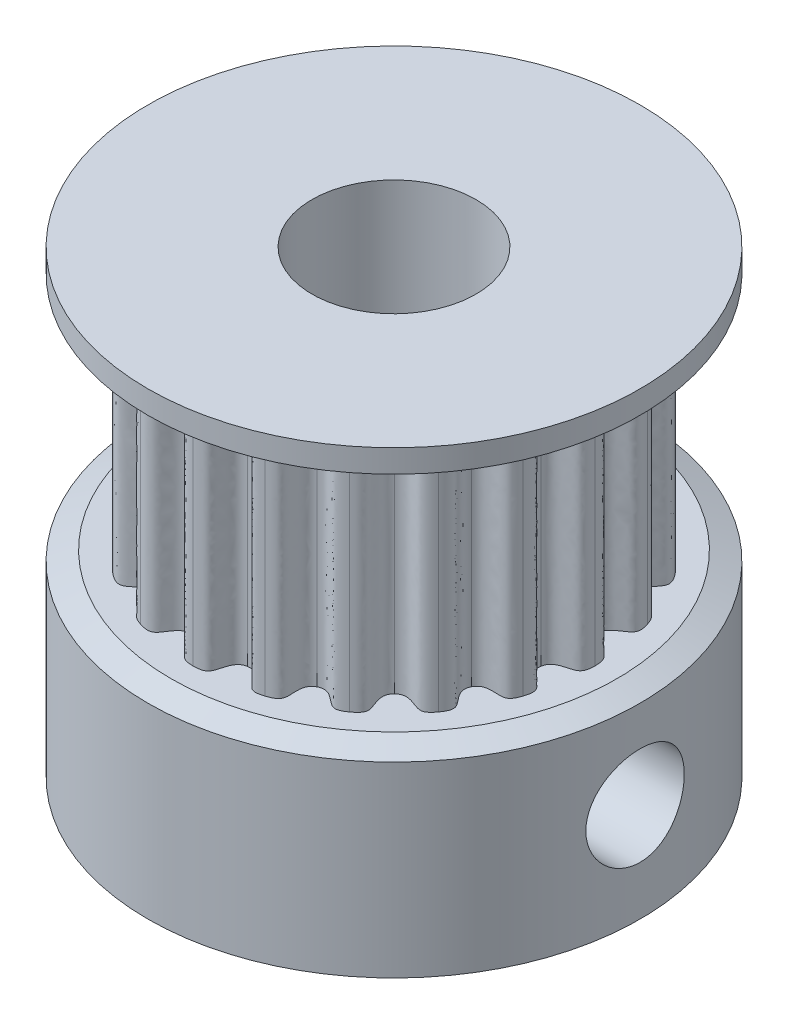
from build123d import *

# Parameters (mm, degrees)
SKETCH1_R           = 7.5
BOSS_EXTRUDE1_DEPTH = 6
BOSS_EXTRUDE2_DEPTH = 7
SKETCH3_R           = 7.5
BOSS_EXTRUDE3_DEPTH = 1
CHAMFER1_SIZE       = 0.7
CHAMFER1_SIZE2      = 0.3
CHAMFER2_SIZE       = 0.3
CHAMFER2_SIZE2      = 0.7
SKETCH4_R           = 2.5
CUT_EXTRUDE1_DEPTH  = 18.56416807
SKETCH5_R           = 1.5
CUT_EXTRUDE2_DEPTH  = 18.56416807
SKETCH6_R           = 1.5
CUT_EXTRUDE3_DEPTH  = 18.564168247


with BuildPart() as part:
    # Sketch1 → Boss-Extrude1 (new body)
    with BuildSketch(Plane(origin=(0, 0, 0), x_dir=(1, 0, 0), z_dir=(0, 1, 0))):
        with Locations(Location((0, 0, 0), (0, 0, 270))):
            Circle(SKETCH1_R)
    extrude(amount=BOSS_EXTRUDE1_DEPTH)

    # Sketch2 → Boss-Extrude2 (add)
    with BuildSketch(Plane(origin=(0, 6, 0), x_dir=(1, 0, 0), z_dir=(0, 1, 0))):
        with BuildLine():
            add(Edge.make_bspline(
                [(-1.893492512, 5.827570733), (-1.625029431, 5.914799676), (-1.358701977, 5.799242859), (-1.173307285, 5.258205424), (-0.848512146, 5.310105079)],
                knots=[0, 0, 0, 0, 0.37473965, 1, 1, 1, 1], degree=3))
            add(Edge.make_bspline(
                [(0, 6.127470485), (-0.288048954, 6.126679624), (-0.521591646, 5.945599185), (-0.520553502, 5.359355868), (-0.848512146, 5.310105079)],
                knots=[0, 0, 0, 0, 0.382401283, 1, 1, 1, 1], degree=3))
            add(Edge.make_bspline(
                [(0, 6.127470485), (0.345787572, 6.127470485), (0.436122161, 5.934324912), (0.547453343, 5.357793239), (0.841221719, 5.3112649)],
                knots=[0, 0, 0, 0, 0.372906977, 1, 1, 1, 1], degree=3))
            add(Edge.make_bspline(
                [(1.893492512, 5.827570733), (1.564628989, 5.934424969), (1.419030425, 5.778647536), (1.134990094, 5.26473656), (0.841221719, 5.3112649)],
                knots=[0, 0, 0, 0, 0.372906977, 1, 1, 1, 1], degree=3))
            add(Edge.make_bspline(
                [(1.893492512, 5.827570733), (2.161955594, 5.74034179), (2.309496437, 5.490311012), (2.141470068, 4.943630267), (2.434740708, 4.794708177)],
                knots=[0, 0, 0, 0, 0.37473965, 1, 1, 1, 1], degree=3))
            add(Edge.make_bspline(
                [(3.601636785, 4.957227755), (3.36813543, 5.125898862), (3.072759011, 5.11667466), (2.729013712, 4.641783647), (2.434740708, 4.794708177)],
                knots=[0, 0, 0, 0, 0.382401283, 1, 1, 1, 1], degree=3))
            add(Edge.make_bspline(
                [(3.601636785, 4.957227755), (3.830005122, 4.791308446), (3.893061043, 4.507922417), (3.564324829, 4.039921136), (3.797222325, 3.8076622)],
                knots=[0, 0, 0, 0, 0.37473965, 1, 1, 1, 1], degree=3))
            add(Edge.make_bspline(
                [(4.957227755, 3.601636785), (4.787277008, 3.834208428), (4.503506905, 3.916712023), (4.029836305, 3.57128697), (3.797222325, 3.8076622)],
                knots=[0, 0, 0, 0, 0.382401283, 1, 1, 1, 1], degree=3))
            add(Edge.make_bspline(
                [(4.957227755, 3.601636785), (5.123147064, 3.373268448), (5.09554571, 3.084266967), (4.638278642, 2.740756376), (4.788005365, 2.447895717)],
                knots=[0, 0, 0, 0, 0.37473965, 1, 1, 1, 1], degree=3))
            add(Edge.make_bspline(
                [(5.827570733, 1.893492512), (5.737806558, 2.167198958), (5.493420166, 2.333354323), (4.936190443, 2.151207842), (4.788005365, 2.447895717)],
                knots=[0, 0, 0, 0, 0.382401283, 1, 1, 1, 1], degree=3))
            add(Edge.make_bspline(
                [(5.827570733, 1.893492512), (5.914799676, 1.625029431), (5.799242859, 1.358701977), (5.258205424, 1.173307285), (5.310105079, 0.848512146)],
                knots=[0, 0, 0, 0, 0.37473965, 1, 1, 1, 1], degree=3))
            add(Edge.make_bspline(
                [(6.127470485, 0), (6.126679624, 0.288048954), (5.945599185, 0.521591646), (5.359355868, 0.520553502), (5.310105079, 0.848512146)],
                knots=[0, 0, 0, 0, 0.382401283, 1, 1, 1, 1], degree=3))
            add(Edge.make_bspline(
                [(6.127470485, 0), (6.127470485, -0.282278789), (5.935269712, -0.499862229), (5.363422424, -0.508993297), (5.312414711, -0.833929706)],
                knots=[0, 0, 0, 0, 0.37473965, 1, 1, 1, 1], degree=3))
            add(Edge.make_bspline(
                [(5.827570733, -1.893492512), (5.915830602, -1.619297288), (5.815781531, -1.341228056), (5.2579102, -1.161056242), (5.312414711, -0.833929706)],
                knots=[0, 0, 0, 0, 0.382401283, 1, 1, 1, 1], degree=3))
            add(Edge.make_bspline(
                [(5.827570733, -1.893492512), (5.74034179, -2.161955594), (5.490311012, -2.309496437), (4.943630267, -2.141470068), (4.794708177, -2.434740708)],
                knots=[0, 0, 0, 0, 0.37473965, 1, 1, 1, 1], degree=3))
            add(Edge.make_bspline(
                [(4.957227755, -3.601636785), (5.125898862, -3.36813543), (5.11667466, -3.072759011), (4.641783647, -2.729013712), (4.794708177, -2.434740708)],
                knots=[0, 0, 0, 0, 0.382401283, 1, 1, 1, 1], degree=3))
            add(Edge.make_bspline(
                [(4.957227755, -3.601636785), (4.791308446, -3.830005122), (4.507922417, -3.893061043), (4.039921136, -3.564324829), (3.8076622, -3.797222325)],
                knots=[0, 0, 0, 0, 0.37473965, 1, 1, 1, 1], degree=3))
            add(Edge.make_bspline(
                [(3.601636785, -4.957227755), (3.834208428, -4.787277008), (3.916712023, -4.503506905), (3.57128697, -4.029836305), (3.8076622, -3.797222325)],
                knots=[0, 0, 0, 0, 0.382401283, 1, 1, 1, 1], degree=3))
            add(Edge.make_bspline(
                [(3.601636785, -4.957227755), (3.373268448, -5.123147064), (3.084266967, -5.09554571), (2.740756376, -4.638278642), (2.447895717, -4.788005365)],
                knots=[0, 0, 0, 0, 0.37473965, 1, 1, 1, 1], degree=3))
            add(Edge.make_bspline(
                [(1.893492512, -5.827570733), (2.167198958, -5.737806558), (2.333354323, -5.493420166), (2.151207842, -4.936190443), (2.447895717, -4.788005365)],
                knots=[0, 0, 0, 0, 0.382401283, 1, 1, 1, 1], degree=3))
            add(Edge.make_bspline(
                [(1.893492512, -5.827570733), (1.625029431, -5.914799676), (1.358701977, -5.799242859), (1.173307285, -5.258205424), (0.848512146, -5.310105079)],
                knots=[0, 0, 0, 0, 0.37473965, 1, 1, 1, 1], degree=3))
            add(Edge.make_bspline(
                [(0, -6.127470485), (0.288048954, -6.126679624), (0.521591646, -5.945599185), (0.520553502, -5.359355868), (0.848512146, -5.310105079)],
                knots=[0, 0, 0, 0, 0.382401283, 1, 1, 1, 1], degree=3))
            add(Edge.make_bspline(
                [(0, -6.127470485), (-0.282278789, -6.127470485), (-0.499862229, -5.935269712), (-0.508993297, -5.363422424), (-0.833929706, -5.312414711)],
                knots=[0, 0, 0, 0, 0.37473965, 1, 1, 1, 1], degree=3))
            add(Edge.make_bspline(
                [(-1.893492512, -5.827570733), (-1.619297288, -5.915830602), (-1.341228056, -5.815781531), (-1.161056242, -5.2579102), (-0.833929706, -5.312414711)],
                knots=[0, 0, 0, 0, 0.382401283, 1, 1, 1, 1], degree=3))
            add(Edge.make_bspline(
                [(-1.893492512, -5.827570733), (-2.161955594, -5.74034179), (-2.309496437, -5.490311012), (-2.141470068, -4.943630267), (-2.434740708, -4.794708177)],
                knots=[0, 0, 0, 0, 0.37473965, 1, 1, 1, 1], degree=3))
            add(Edge.make_bspline(
                [(-3.601636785, -4.957227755), (-3.36813543, -5.125898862), (-3.072759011, -5.11667466), (-2.729013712, -4.641783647), (-2.434740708, -4.794708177)],
                knots=[0, 0, 0, 0, 0.382401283, 1, 1, 1, 1], degree=3))
            add(Edge.make_bspline(
                [(-3.601636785, -4.957227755), (-3.830005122, -4.791308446), (-3.893061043, -4.507922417), (-3.564324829, -4.039921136), (-3.797222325, -3.8076622)],
                knots=[0, 0, 0, 0, 0.37473965, 1, 1, 1, 1], degree=3))
            add(Edge.make_bspline(
                [(-4.957227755, -3.601636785), (-4.787277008, -3.834208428), (-4.503506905, -3.916712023), (-4.029836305, -3.57128697), (-3.797222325, -3.8076622)],
                knots=[0, 0, 0, 0, 0.382401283, 1, 1, 1, 1], degree=3))
            add(Edge.make_bspline(
                [(-4.957227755, -3.601636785), (-5.123147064, -3.373268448), (-5.09554571, -3.084266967), (-4.638278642, -2.740756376), (-4.788005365, -2.447895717)],
                knots=[0, 0, 0, 0, 0.37473965, 1, 1, 1, 1], degree=3))
            add(Edge.make_bspline(
                [(-5.827570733, -1.893492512), (-5.737806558, -2.167198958), (-5.493420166, -2.333354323), (-4.936190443, -2.151207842), (-4.788005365, -2.447895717)],
                knots=[0, 0, 0, 0, 0.382401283, 1, 1, 1, 1], degree=3))
            add(Edge.make_bspline(
                [(-5.827570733, -1.893492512), (-5.914799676, -1.625029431), (-5.799242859, -1.358701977), (-5.258205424, -1.173307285), (-5.310105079, -0.848512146)],
                knots=[0, 0, 0, 0, 0.37473965, 1, 1, 1, 1], degree=3))
            add(Edge.make_bspline(
                [(-6.127470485, 0), (-6.126679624, -0.288048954), (-5.945599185, -0.521591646), (-5.359355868, -0.520553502), (-5.310105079, -0.848512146)],
                knots=[0, 0, 0, 0, 0.382401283, 1, 1, 1, 1], degree=3))
            add(Edge.make_bspline(
                [(-6.127470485, 0), (-6.127470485, 0.282278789), (-5.935269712, 0.499862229), (-5.363422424, 0.508993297), (-5.312414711, 0.833929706)],
                knots=[0, 0, 0, 0, 0.37473965, 1, 1, 1, 1], degree=3))
            add(Edge.make_bspline(
                [(-5.827570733, 1.893492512), (-5.915830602, 1.619297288), (-5.815781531, 1.341228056), (-5.2579102, 1.161056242), (-5.312414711, 0.833929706)],
                knots=[0, 0, 0, 0, 0.382401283, 1, 1, 1, 1], degree=3))
            add(Edge.make_bspline(
                [(-5.827570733, 1.893492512), (-5.74034179, 2.161955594), (-5.490311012, 2.309496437), (-4.943630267, 2.141470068), (-4.794708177, 2.434740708)],
                knots=[0, 0, 0, 0, 0.37473965, 1, 1, 1, 1], degree=3))
            add(Edge.make_bspline(
                [(-4.957227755, 3.601636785), (-5.125898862, 3.36813543), (-5.11667466, 3.072759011), (-4.641783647, 2.729013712), (-4.794708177, 2.434740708)],
                knots=[0, 0, 0, 0, 0.382401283, 1, 1, 1, 1], degree=3))
            add(Edge.make_bspline(
                [(-4.957227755, 3.601636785), (-4.791308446, 3.830005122), (-4.507922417, 3.893061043), (-4.039921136, 3.564324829), (-3.8076622, 3.797222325)],
                knots=[0, 0, 0, 0, 0.37473965, 1, 1, 1, 1], degree=3))
            add(Edge.make_bspline(
                [(-3.601636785, 4.957227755), (-3.834208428, 4.787277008), (-3.916712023, 4.503506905), (-3.57128697, 4.029836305), (-3.8076622, 3.797222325)],
                knots=[0, 0, 0, 0, 0.382401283, 1, 1, 1, 1], degree=3))
            add(Edge.make_bspline(
                [(-3.601636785, 4.957227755), (-3.373268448, 5.123147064), (-3.084266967, 5.09554571), (-2.740756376, 4.638278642), (-2.447895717, 4.788005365)],
                knots=[0, 0, 0, 0, 0.37473965, 1, 1, 1, 1], degree=3))
            add(Edge.make_bspline(
                [(-1.893492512, 5.827570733), (-2.167198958, 5.737806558), (-2.333354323, 5.493420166), (-2.151207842, 4.936190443), (-2.447895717, 4.788005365)],
                knots=[0, 0, 0, 0, 0.382401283, 1, 1, 1, 1], degree=3))
        make_face()
    extrude(amount=BOSS_EXTRUDE2_DEPTH)

    # Sketch3 → Boss-Extrude3 (add)
    with BuildSketch(Plane(origin=(0, 13, 0), x_dir=(1, 0, 0), z_dir=(0, 1, 0))):
        with Locations(Location((0, 0, 0), (0, 0, 270))):
            Circle(SKETCH3_R)
    extrude(amount=BOSS_EXTRUDE3_DEPTH)

    # Chamfer1
    chamfer1_edges = [part.edges().sort_by_distance(p)[0] for p in [
        (0, 13, -7.5),
    ]]
    chamfer1_side = [part.faces().sort_by_distance(p)[0] for p in [
        (0, 13, -7.287867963),
    ]]
    chamfer(chamfer1_edges, length=CHAMFER1_SIZE, length2=CHAMFER1_SIZE2, reference=chamfer1_side[0])

    # Chamfer2
    chamfer2_edges = [part.edges().sort_by_distance(p)[0] for p in [
        (0, 6, -7.5),
    ]]
    chamfer2_side = [part.faces().sort_by_distance(p)[0] for p in [
        (0, 3, -7.5),
    ]]
    chamfer(chamfer2_edges, length=CHAMFER2_SIZE, length2=CHAMFER2_SIZE2, reference=chamfer2_side[0])

    # Sketch4 → Cut-Extrude1 (cut, through all)
    with BuildSketch(Plane.XZ):
        with Locations(Location((0, 0, 0), (0, 0, 270))):
            Circle(SKETCH4_R)
    extrude(amount=-CUT_EXTRUDE1_DEPTH, mode=Mode.SUBTRACT)

    # Sketch5 → Cut-Extrude2 (cut, through all)
    with BuildSketch(Plane(origin=(0, 0, 0), x_dir=(0, 0, -1), z_dir=(1, 0, 0))):
        with Locations(Location((0, 3, 0), (0, 0, 180))):
            Circle(SKETCH5_R)
    extrude(amount=CUT_EXTRUDE2_DEPTH, mode=Mode.SUBTRACT)

    # Sketch6 → Cut-Extrude3 (cut, through all)
    with BuildSketch(Plane.XY):
        with Locations(Location((0, 3, 0), (0, 0, 90))):
            Circle(SKETCH6_R)
    extrude(amount=-CUT_EXTRUDE3_DEPTH, mode=Mode.SUBTRACT)


solid = part.part
